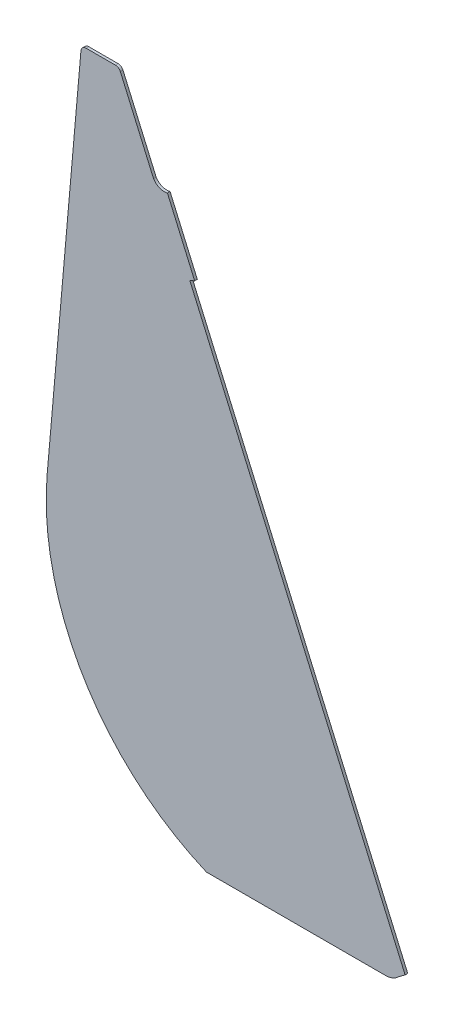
ISO-10303-21;
HEADER;
FILE_DESCRIPTION(('STEP AP214'),'2;1');
FILE_NAME('part.step','',(''),(''),'','','');
FILE_SCHEMA(('AUTOMOTIVE_DESIGN { 1 0 10303 214 1 1 1 1 }'));
ENDSEC;
DATA;
#1=APPLICATION_CONTEXT('core data for automotive mechanical design processes');
#2=APPLICATION_PROTOCOL_DEFINITION('international standard','automotive_design',2000,#1);
#3=PRODUCT_CONTEXT('',#1,'mechanical');
#4=PRODUCT('Part','Part','',(#3));
#5=PRODUCT_RELATED_PRODUCT_CATEGORY('part','',(#4));
#6=PRODUCT_DEFINITION_FORMATION('','',#4);
#7=PRODUCT_DEFINITION_CONTEXT('part definition',#1,'design');
#8=PRODUCT_DEFINITION('design','',#6,#7);
#9=PRODUCT_DEFINITION_SHAPE('','',#8);
#10=(LENGTH_UNIT() NAMED_UNIT(*) SI_UNIT(.MILLI.,.METRE.));
#11=(NAMED_UNIT(*) PLANE_ANGLE_UNIT() SI_UNIT($,.RADIAN.));
#12=(NAMED_UNIT(*) SI_UNIT($,.STERADIAN.) SOLID_ANGLE_UNIT());
#13=UNCERTAINTY_MEASURE_WITH_UNIT(LENGTH_MEASURE(1.E-05),#10,'distance_accuracy_value','');
#14=(GEOMETRIC_REPRESENTATION_CONTEXT(3) GLOBAL_UNCERTAINTY_ASSIGNED_CONTEXT((#13)) GLOBAL_UNIT_ASSIGNED_CONTEXT((#10,
#11,#12)) REPRESENTATION_CONTEXT('',''));
#15=CARTESIAN_POINT('',(0.,0.,0.));
#16=DIRECTION('',(0.,0.,1.));
#17=DIRECTION('',(1.,0.,0.));
#18=AXIS2_PLACEMENT_3D('',#15,#16,#17);
#19=CARTESIAN_POINT('',(-175.372398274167,407.66313630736,3.175));
#20=DIRECTION('',(0.,0.,-1.));
#21=DIRECTION('',(-1.,0.,0.));
#22=AXIS2_PLACEMENT_3D('',#19,#20,#21);
#23=CYLINDRICAL_SURFACE('',#22,15.0225257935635);
#24=CARTESIAN_POINT('',(-175.372398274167,407.66313630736,0.));
#25=DIRECTION('',(0.,0.,-1.));
#26=DIRECTION('',(-1.,0.,0.));
#27=AXIS2_PLACEMENT_3D('',#24,#25,#26);
#28=CIRCLE('',#27,15.0225257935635);
#29=CARTESIAN_POINT('',(-171.416461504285,393.170833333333,0.));
#30=VERTEX_POINT('',#29);
#31=CARTESIAN_POINT('',(-188.133716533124,399.736911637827,0.));
#32=VERTEX_POINT('',#31);
#33=EDGE_CURVE('E168',#30,#32,#28,.T.);
#34=ORIENTED_EDGE('',*,*,#33,.T.);
#35=DIRECTION('',(0.,0.,-1.));
#36=VECTOR('',#35,1.);
#37=CARTESIAN_POINT('',(-188.133716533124,399.736911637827,3.175));
#38=LINE('',#37,#36);
#39=CARTESIAN_POINT('',(-188.133716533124,399.736911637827,3.175));
#40=VERTEX_POINT('',#39);
#41=EDGE_CURVE('E46',#40,#32,#38,.T.);
#42=ORIENTED_EDGE('',*,*,#41,.F.);
#43=CARTESIAN_POINT('',(-175.372398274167,407.66313630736,3.175));
#44=DIRECTION('',(0.,0.,-1.));
#45=DIRECTION('',(-1.,0.,0.));
#46=AXIS2_PLACEMENT_3D('',#43,#44,#45);
#47=CIRCLE('',#46,15.0225257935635);
#48=CARTESIAN_POINT('',(-171.416461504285,393.170833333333,3.175));
#49=VERTEX_POINT('',#48);
#50=EDGE_CURVE('E219',#49,#40,#47,.T.);
#51=ORIENTED_EDGE('',*,*,#50,.F.);
#52=DIRECTION('',(0.,0.,-1.));
#53=VECTOR('',#52,1.);
#54=CARTESIAN_POINT('',(-171.416461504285,393.170833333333,3.175));
#55=LINE('',#54,#53);
#56=EDGE_CURVE('E11',#49,#30,#55,.T.);
#57=ORIENTED_EDGE('',*,*,#56,.T.);
#58=EDGE_LOOP('',(#34,#42,#51,#57));
#59=FACE_BOUND('',#58,.T.);
#60=ADVANCED_FACE('F38',(#59),#23,.F.);
#61=CARTESIAN_POINT('',(-224.260753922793,482.6,3.175));
#62=DIRECTION('',(-0.916666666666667,-0.399652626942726,0.));
#63=DIRECTION('',(0.399652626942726,-0.916666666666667,0.));
#64=AXIS2_PLACEMENT_3D('',#61,#62,#63);
#65=PLANE('',#64);
#66=DIRECTION('',(-0.399652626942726,0.916666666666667,0.));
#67=VECTOR('',#66,1.);
#68=CARTESIAN_POINT('',(-224.260753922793,482.6,0.));
#69=LINE('',#68,#67);
#70=CARTESIAN_POINT('',(-228.135696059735,491.487794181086,0.));
#71=VERTEX_POINT('',#70);
#72=EDGE_CURVE('E171',#32,#71,#69,.T.);
#73=ORIENTED_EDGE('',*,*,#72,.T.);
#74=DIRECTION('',(0.,0.,-1.));
#75=VECTOR('',#74,1.);
#76=CARTESIAN_POINT('',(-228.135696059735,491.487794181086,3.175));
#77=LINE('',#76,#75);
#78=CARTESIAN_POINT('',(-228.135696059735,491.487794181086,3.175));
#79=VERTEX_POINT('',#78);
#80=EDGE_CURVE('E208',#79,#71,#77,.T.);
#81=ORIENTED_EDGE('',*,*,#80,.F.);
#82=DIRECTION('',(-0.399652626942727,0.916666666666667,0.));
#83=VECTOR('',#82,1.);
#84=CARTESIAN_POINT('',(-188.133716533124,399.736911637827,3.175));
#85=LINE('',#84,#83);
#86=EDGE_CURVE('E216',#40,#79,#85,.T.);
#87=ORIENTED_EDGE('',*,*,#86,.F.);
#88=ORIENTED_EDGE('',*,*,#41,.T.);
#89=EDGE_LOOP('',(#73,#81,#87,#88));
#90=FACE_BOUND('',#89,.T.);
#91=ADVANCED_FACE('F214',(#90),#65,.F.);
#92=CARTESIAN_POINT('',(-233.956529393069,488.95,3.175));
#93=DIRECTION('',(0.,0.,-1.));
#94=DIRECTION('',(-1.,0.,0.));
#95=AXIS2_PLACEMENT_3D('',#92,#93,#94);
#96=CYLINDRICAL_SURFACE('',#95,6.34999999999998);
#97=CARTESIAN_POINT('',(-233.956529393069,488.95,0.));
#98=DIRECTION('',(0.,0.,1.));
#99=DIRECTION('',(1.,0.,0.));
#100=AXIS2_PLACEMENT_3D('',#97,#98,#99);
#101=CIRCLE('',#100,6.34999999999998);
#102=CARTESIAN_POINT('',(-233.956529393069,495.3,0.));
#103=VERTEX_POINT('',#102);
#104=EDGE_CURVE('E174',#71,#103,#101,.T.);
#105=ORIENTED_EDGE('',*,*,#104,.T.);
#106=DIRECTION('',(0.,0.,-1.));
#107=VECTOR('',#106,1.);
#108=CARTESIAN_POINT('',(-233.956529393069,495.3,3.175));
#109=LINE('',#108,#107);
#110=CARTESIAN_POINT('',(-233.956529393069,495.3,3.175));
#111=VERTEX_POINT('',#110);
#112=EDGE_CURVE('E205',#111,#103,#109,.T.);
#113=ORIENTED_EDGE('',*,*,#112,.F.);
#114=CARTESIAN_POINT('',(-233.956529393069,488.95,3.175));
#115=DIRECTION('',(0.,0.,1.));
#116=DIRECTION('',(1.,0.,0.));
#117=AXIS2_PLACEMENT_3D('',#114,#115,#116);
#118=CIRCLE('',#117,6.34999999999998);
#119=EDGE_CURVE('E241',#79,#111,#118,.T.);
#120=ORIENTED_EDGE('',*,*,#119,.F.);
#121=ORIENTED_EDGE('',*,*,#80,.T.);
#122=EDGE_LOOP('',(#105,#113,#120,#121));
#123=FACE_BOUND('',#122,.T.);
#124=ADVANCED_FACE('F232',(#123),#96,.T.);
#125=CARTESIAN_POINT('',(-233.956529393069,495.3,3.175));
#126=DIRECTION('',(0.,-1.,0.));
#127=DIRECTION('',(0.,0.,-1.));
#128=AXIS2_PLACEMENT_3D('',#125,#126,#127);
#129=PLANE('',#128);
#130=DIRECTION('',(-1.,0.,0.));
#131=VECTOR('',#130,1.);
#132=CARTESIAN_POINT('',(-233.956529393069,495.3,0.));
#133=LINE('',#132,#131);
#134=CARTESIAN_POINT('',(-269.302608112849,495.3,0.));
#135=VERTEX_POINT('',#134);
#136=EDGE_CURVE('E176',#103,#135,#133,.T.);
#137=ORIENTED_EDGE('',*,*,#136,.T.);
#138=DIRECTION('',(0.,0.,-1.));
#139=VECTOR('',#138,1.);
#140=CARTESIAN_POINT('',(-269.302608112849,495.3,3.175));
#141=LINE('',#140,#139);
#142=CARTESIAN_POINT('',(-269.302608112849,495.3,3.175));
#143=VERTEX_POINT('',#142);
#144=EDGE_CURVE('E202',#143,#135,#141,.T.);
#145=ORIENTED_EDGE('',*,*,#144,.F.);
#146=DIRECTION('',(-1.,0.,0.));
#147=VECTOR('',#146,1.);
#148=CARTESIAN_POINT('',(-233.956529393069,495.3,3.175));
#149=LINE('',#148,#147);
#150=EDGE_CURVE('E238',#111,#143,#149,.T.);
#151=ORIENTED_EDGE('',*,*,#150,.F.);
#152=ORIENTED_EDGE('',*,*,#112,.T.);
#153=EDGE_LOOP('',(#137,#145,#151,#152));
#154=FACE_BOUND('',#153,.T.);
#155=ADVANCED_FACE('F236',(#154),#129,.F.);
#156=CARTESIAN_POINT('',(-269.302608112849,488.95,3.175));
#157=DIRECTION('',(0.,0.,-1.));
#158=DIRECTION('',(-1.,0.,0.));
#159=AXIS2_PLACEMENT_3D('',#156,#157,#158);
#160=CYLINDRICAL_SURFACE('',#159,6.35000000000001);
#161=CARTESIAN_POINT('',(-269.302608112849,488.95,0.));
#162=DIRECTION('',(0.,0.,1.));
#163=DIRECTION('',(1.,0.,0.));
#164=AXIS2_PLACEMENT_3D('',#161,#162,#163);
#165=CIRCLE('',#164,6.35000000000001);
#166=CARTESIAN_POINT('',(-275.628136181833,489.506951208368,0.));
#167=VERTEX_POINT('',#166);
#168=EDGE_CURVE('E178',#135,#167,#165,.T.);
#169=ORIENTED_EDGE('',*,*,#168,.T.);
#170=DIRECTION('',(0.,0.,-1.));
#171=VECTOR('',#170,1.);
#172=CARTESIAN_POINT('',(-275.628136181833,489.506951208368,3.175));
#173=LINE('',#172,#171);
#174=CARTESIAN_POINT('',(-275.628136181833,489.506951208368,3.175));
#175=VERTEX_POINT('',#174);
#176=EDGE_CURVE('E199',#175,#167,#173,.T.);
#177=ORIENTED_EDGE('',*,*,#176,.F.);
#178=CARTESIAN_POINT('',(-269.302608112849,488.95,3.175));
#179=DIRECTION('',(0.,0.,1.));
#180=DIRECTION('',(1.,0.,0.));
#181=AXIS2_PLACEMENT_3D('',#178,#179,#180);
#182=CIRCLE('',#181,6.35000000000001);
#183=EDGE_CURVE('E240',#143,#175,#182,.T.);
#184=ORIENTED_EDGE('',*,*,#183,.F.);
#185=ORIENTED_EDGE('',*,*,#144,.T.);
#186=EDGE_LOOP('',(#169,#177,#184,#185));
#187=FACE_BOUND('',#186,.T.);
#188=ADVANCED_FACE('F303',(#187),#160,.T.);
#189=CARTESIAN_POINT('',(-275.628136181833,489.506951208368,3.175));
#190=DIRECTION('',(0.996146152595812,-0.0877088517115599,0.));
#191=DIRECTION('',(0.0877088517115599,0.996146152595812,0.));
#192=AXIS2_PLACEMENT_3D('',#189,#190,#191);
#193=PLANE('',#192);
#194=DIRECTION('',(-0.0877088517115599,-0.996146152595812,0.));
#195=VECTOR('',#194,1.);
#196=CARTESIAN_POINT('',(-275.628136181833,489.506951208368,0.));
#197=LINE('',#196,#195);
#198=CARTESIAN_POINT('',(-316.27640344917,27.8475604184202,0.));
#199=VERTEX_POINT('',#198);
#200=EDGE_CURVE('E180',#167,#199,#197,.T.);
#201=ORIENTED_EDGE('',*,*,#200,.T.);
#202=DIRECTION('',(0.,0.,-1.));
#203=VECTOR('',#202,1.);
#204=CARTESIAN_POINT('',(-316.27640344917,27.8475604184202,3.175));
#205=LINE('',#204,#203);
#206=CARTESIAN_POINT('',(-316.27640344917,27.8475604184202,3.175));
#207=VERTEX_POINT('',#206);
#208=EDGE_CURVE('E153',#207,#199,#205,.T.);
#209=ORIENTED_EDGE('',*,*,#208,.F.);
#210=DIRECTION('',(-0.0877088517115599,-0.996146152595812,0.));
#211=VECTOR('',#210,1.);
#212=CARTESIAN_POINT('',(-275.628136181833,489.506951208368,3.175));
#213=LINE('',#212,#211);
#214=EDGE_CURVE('E142',#175,#207,#213,.T.);
#215=ORIENTED_EDGE('',*,*,#214,.F.);
#216=ORIENTED_EDGE('',*,*,#176,.T.);
#217=EDGE_LOOP('',(#201,#209,#215,#216));
#218=FACE_BOUND('',#217,.T.);
#219=ADVANCED_FACE('F300',(#218),#193,.F.);
#220=CARTESIAN_POINT('',(0.,0.,3.175));
#221=DIRECTION('',(0.,0.,-1.));
#222=DIRECTION('',(-1.,0.,0.));
#223=AXIS2_PLACEMENT_3D('',#220,#221,#222);
#224=CYLINDRICAL_SURFACE('',#223,317.5);
#225=CARTESIAN_POINT('',(0.,0.,0.));
#226=DIRECTION('',(0.,0.,1.));
#227=DIRECTION('',(1.,0.,0.));
#228=AXIS2_PLACEMENT_3D('',#225,#226,#227);
#229=CIRCLE('',#228,317.5);
#230=CARTESIAN_POINT('',(-124.434078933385,-292.1,0.));
#231=VERTEX_POINT('',#230);
#232=EDGE_CURVE('E151',#199,#231,#229,.T.);
#233=ORIENTED_EDGE('',*,*,#232,.T.);
#234=DIRECTION('',(0.,0.,-1.));
#235=VECTOR('',#234,1.);
#236=CARTESIAN_POINT('',(-124.434078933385,-292.1,3.175));
#237=LINE('',#236,#235);
#238=CARTESIAN_POINT('',(-124.434078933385,-292.1,3.175));
#239=VERTEX_POINT('',#238);
#240=EDGE_CURVE('E148',#239,#231,#237,.T.);
#241=ORIENTED_EDGE('',*,*,#240,.F.);
#242=CARTESIAN_POINT('',(0.,0.,3.175));
#243=DIRECTION('',(0.,0.,1.));
#244=DIRECTION('',(1.,0.,0.));
#245=AXIS2_PLACEMENT_3D('',#242,#243,#244);
#246=CIRCLE('',#245,317.5);
#247=EDGE_CURVE('E136',#207,#239,#246,.T.);
#248=ORIENTED_EDGE('',*,*,#247,.F.);
#249=ORIENTED_EDGE('',*,*,#208,.T.);
#250=EDGE_LOOP('',(#233,#241,#248,#249));
#251=FACE_BOUND('',#250,.T.);
#252=ADVANCED_FACE('F149',(#251),#224,.T.);
#253=CARTESIAN_POINT('',(-124.434078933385,-292.1,3.175));
#254=DIRECTION('',(0.,1.,0.));
#255=DIRECTION('',(-1.,0.,0.));
#256=AXIS2_PLACEMENT_3D('',#253,#254,#255);
#257=PLANE('',#256);
#258=DIRECTION('',(1.,0.,0.));
#259=VECTOR('',#258,1.);
#260=CARTESIAN_POINT('',(-124.434078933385,-292.1,0.));
#261=LINE('',#260,#259);
#262=CARTESIAN_POINT('',(91.44,-292.1,0.));
#263=VERTEX_POINT('',#262);
#264=EDGE_CURVE('E96',#231,#263,#261,.T.);
#265=ORIENTED_EDGE('',*,*,#264,.T.);
#266=DIRECTION('',(0.,0.,-1.));
#267=VECTOR('',#266,1.);
#268=CARTESIAN_POINT('',(91.44,-292.1,3.175));
#269=LINE('',#268,#267);
#270=CARTESIAN_POINT('',(91.44,-292.1,3.175));
#271=VERTEX_POINT('',#270);
#272=EDGE_CURVE('E154',#271,#263,#269,.T.);
#273=ORIENTED_EDGE('',*,*,#272,.F.);
#274=DIRECTION('',(1.,0.,0.));
#275=VECTOR('',#274,1.);
#276=CARTESIAN_POINT('',(-124.434078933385,-292.1,3.175));
#277=LINE('',#276,#275);
#278=EDGE_CURVE('E140',#239,#271,#277,.T.);
#279=ORIENTED_EDGE('',*,*,#278,.F.);
#280=ORIENTED_EDGE('',*,*,#240,.T.);
#281=EDGE_LOOP('',(#265,#273,#279,#280));
#282=FACE_BOUND('',#281,.T.);
#283=ADVANCED_FACE('F156',(#282),#257,.F.);
#284=CARTESIAN_POINT('',(91.44,-269.875,3.175));
#285=DIRECTION('',(0.,0.,-1.));
#286=DIRECTION('',(-1.,0.,0.));
#287=AXIS2_PLACEMENT_3D('',#284,#285,#286);
#288=CYLINDRICAL_SURFACE('',#287,22.225);
#289=CARTESIAN_POINT('',(91.44,-269.875,0.));
#290=DIRECTION('',(0.,0.,1.));
#291=DIRECTION('',(1.,0.,0.));
#292=AXIS2_PLACEMENT_3D('',#289,#290,#291);
#293=CIRCLE('',#292,22.225);
#294=CARTESIAN_POINT('',(107.309314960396,-285.435060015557,0.));
#295=VERTEX_POINT('',#294);
#296=EDGE_CURVE('E103',#263,#295,#293,.T.);
#297=ORIENTED_EDGE('',*,*,#296,.T.);
#298=DIRECTION('',(0.,0.,-1.));
#299=VECTOR('',#298,1.);
#300=CARTESIAN_POINT('',(107.309314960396,-285.435060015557,3.175));
#301=LINE('',#300,#299);
#302=CARTESIAN_POINT('',(107.309314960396,-285.435060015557,3.175));
#303=VERTEX_POINT('',#302);
#304=EDGE_CURVE('E167',#303,#295,#301,.T.);
#305=ORIENTED_EDGE('',*,*,#304,.F.);
#306=CARTESIAN_POINT('',(91.44,-269.875,3.175));
#307=DIRECTION('',(0.,0.,1.));
#308=DIRECTION('',(1.,0.,0.));
#309=AXIS2_PLACEMENT_3D('',#306,#307,#308);
#310=CIRCLE('',#309,22.225);
#311=EDGE_CURVE('E57',#271,#303,#310,.T.);
#312=ORIENTED_EDGE('',*,*,#311,.F.);
#313=ORIENTED_EDGE('',*,*,#272,.T.);
#314=EDGE_LOOP('',(#297,#305,#312,#313));
#315=FACE_BOUND('',#314,.T.);
#316=ADVANCED_FACE('F353',(#315),#288,.T.);
#317=CARTESIAN_POINT('',(120.261045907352,-275.837776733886,3.175));
#318=DIRECTION('',(-0.595364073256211,0.803456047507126,0.));
#319=DIRECTION('',(-0.803456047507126,-0.595364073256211,0.));
#320=AXIS2_PLACEMENT_3D('',#317,#318,#319);
#321=PLANE('',#320);
#322=DIRECTION('',(0.803456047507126,0.595364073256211,0.));
#323=VECTOR('',#322,1.);
#324=CARTESIAN_POINT('',(120.261045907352,-275.837776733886,0.));
#325=LINE('',#324,#323);
#326=CARTESIAN_POINT('',(115.025274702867,-279.717503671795,0.));
#327=VERTEX_POINT('',#326);
#328=EDGE_CURVE('E187',#295,#327,#325,.T.);
#329=ORIENTED_EDGE('',*,*,#328,.T.);
#330=DIRECTION('',(0.,0.,1.));
#331=VECTOR('',#330,1.);
#332=CARTESIAN_POINT('',(115.025274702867,-279.717503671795,3.175));
#333=LINE('',#332,#331);
#334=CARTESIAN_POINT('',(115.025274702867,-279.717503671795,3.175));
#335=VERTEX_POINT('',#334);
#336=EDGE_CURVE('E262',#327,#335,#333,.T.);
#337=ORIENTED_EDGE('',*,*,#336,.T.);
#338=DIRECTION('',(0.803456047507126,0.595364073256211,0.));
#339=VECTOR('',#338,1.);
#340=CARTESIAN_POINT('',(120.261045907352,-275.837776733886,3.175));
#341=LINE('',#340,#339);
#342=EDGE_CURVE('E161',#303,#335,#341,.T.);
#343=ORIENTED_EDGE('',*,*,#342,.F.);
#344=ORIENTED_EDGE('',*,*,#304,.T.);
#345=EDGE_LOOP('',(#329,#337,#343,#344));
#346=FACE_BOUND('',#345,.T.);
#347=ADVANCED_FACE('F279',(#346),#321,.F.);
#348=CARTESIAN_POINT('',(116.277115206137,-266.7,3.175));
#349=DIRECTION('',(-0.916666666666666,-0.399652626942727,0.));
#350=DIRECTION('',(0.399652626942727,-0.916666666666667,0.));
#351=AXIS2_PLACEMENT_3D('',#348,#349,#350);
#352=PLANE('',#351);
#353=DIRECTION('',(-0.399652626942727,0.916666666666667,0.));
#354=VECTOR('',#353,1.);
#355=CARTESIAN_POINT('',(0.,0.,3.175));
#356=LINE('',#355,#354);
#357=CARTESIAN_POINT('',(-138.593960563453,317.887223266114,3.175));
#358=VERTEX_POINT('',#357);
#359=EDGE_CURVE('E111',#358,#49,#356,.T.);
#360=ORIENTED_EDGE('',*,*,#359,.F.);
#361=DIRECTION('',(0.,0.,1.));
#362=VECTOR('',#361,1.);
#363=CARTESIAN_POINT('',(-138.593960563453,317.887223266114,0.));
#364=LINE('',#363,#362);
#365=CARTESIAN_POINT('',(-138.593960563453,317.887223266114,0.));
#366=VERTEX_POINT('',#365);
#367=EDGE_CURVE('E257',#366,#358,#364,.T.);
#368=ORIENTED_EDGE('',*,*,#367,.F.);
#369=DIRECTION('',(-0.399652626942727,0.916666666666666,0.));
#370=VECTOR('',#369,1.);
#371=CARTESIAN_POINT('',(116.277115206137,-266.7,0.));
#372=LINE('',#371,#370);
#373=EDGE_CURVE('E191',#366,#30,#372,.T.);
#374=ORIENTED_EDGE('',*,*,#373,.T.);
#375=ORIENTED_EDGE('',*,*,#56,.F.);
#376=EDGE_LOOP('',(#360,#368,#374,#375));
#377=FACE_BOUND('',#376,.T.);
#378=ADVANCED_FACE('F368',(#377),#352,.F.);
#379=CARTESIAN_POINT('',(-175.372398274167,407.66313630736,3.175));
#380=DIRECTION('',(0.,0.,-1.));
#381=DIRECTION('',(-1.,0.,0.));
#382=AXIS2_PLACEMENT_3D('',#379,#380,#381);
#383=PLANE('',#382);
#384=ORIENTED_EDGE('',*,*,#342,.T.);
#385=DIRECTION('',(0.399652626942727,-0.916666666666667,0.));
#386=VECTOR('',#385,1.);
#387=CARTESIAN_POINT('',(114.440212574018,-278.375570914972,3.175));
#388=LINE('',#387,#386);
#389=CARTESIAN_POINT('',(-144.414793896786,315.349429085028,3.175));
#390=VERTEX_POINT('',#389);
#391=EDGE_CURVE('E254',#390,#335,#388,.T.);
#392=ORIENTED_EDGE('',*,*,#391,.F.);
#393=DIRECTION('',(0.916666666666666,0.399652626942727,0.));
#394=VECTOR('',#393,1.);
#395=CARTESIAN_POINT('',(-144.414793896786,315.349429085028,3.175));
#396=LINE('',#395,#394);
#397=EDGE_CURVE('E172',#390,#358,#396,.T.);
#398=ORIENTED_EDGE('',*,*,#397,.T.);
#399=ORIENTED_EDGE('',*,*,#359,.T.);
#400=ORIENTED_EDGE('',*,*,#50,.T.);
#401=ORIENTED_EDGE('',*,*,#86,.T.);
#402=ORIENTED_EDGE('',*,*,#119,.T.);
#403=ORIENTED_EDGE('',*,*,#150,.T.);
#404=ORIENTED_EDGE('',*,*,#183,.T.);
#405=ORIENTED_EDGE('',*,*,#214,.T.);
#406=ORIENTED_EDGE('',*,*,#247,.T.);
#407=ORIENTED_EDGE('',*,*,#278,.T.);
#408=ORIENTED_EDGE('',*,*,#311,.T.);
#409=EDGE_LOOP('',(#384,#392,#398,#399,#400,#401,#402,#403,#404,#405,#406,#407,#408));
#410=FACE_BOUND('',#409,.T.);
#411=ADVANCED_FACE('F138',(#410),#383,.F.);
#412=CARTESIAN_POINT('',(-175.372398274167,407.66313630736,0.));
#413=DIRECTION('',(0.,0.,-1.));
#414=DIRECTION('',(-1.,0.,0.));
#415=AXIS2_PLACEMENT_3D('',#412,#413,#414);
#416=PLANE('',#415);
#417=DIRECTION('',(-0.399652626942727,0.916666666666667,0.));
#418=VECTOR('',#417,1.);
#419=CARTESIAN_POINT('',(114.440212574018,-278.375570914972,0.));
#420=LINE('',#419,#418);
#421=CARTESIAN_POINT('',(-144.414793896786,315.349429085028,0.));
#422=VERTEX_POINT('',#421);
#423=EDGE_CURVE('E261',#327,#422,#420,.T.);
#424=ORIENTED_EDGE('',*,*,#423,.F.);
#425=ORIENTED_EDGE('',*,*,#328,.F.);
#426=ORIENTED_EDGE('',*,*,#296,.F.);
#427=ORIENTED_EDGE('',*,*,#264,.F.);
#428=ORIENTED_EDGE('',*,*,#232,.F.);
#429=ORIENTED_EDGE('',*,*,#200,.F.);
#430=ORIENTED_EDGE('',*,*,#168,.F.);
#431=ORIENTED_EDGE('',*,*,#136,.F.);
#432=ORIENTED_EDGE('',*,*,#104,.F.);
#433=ORIENTED_EDGE('',*,*,#72,.F.);
#434=ORIENTED_EDGE('',*,*,#33,.F.);
#435=ORIENTED_EDGE('',*,*,#373,.F.);
#436=DIRECTION('',(0.916666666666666,0.399652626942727,0.));
#437=VECTOR('',#436,1.);
#438=CARTESIAN_POINT('',(-144.414793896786,315.349429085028,0.));
#439=LINE('',#438,#437);
#440=EDGE_CURVE('E250',#422,#366,#439,.T.);
#441=ORIENTED_EDGE('',*,*,#440,.F.);
#442=EDGE_LOOP('',(#424,#425,#426,#427,#428,#429,#430,#431,#432,#433,#434,#435,#441));
#443=FACE_BOUND('',#442,.T.);
#444=ADVANCED_FACE('F224',(#443),#416,.T.);
#445=CARTESIAN_POINT('',(-144.414793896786,315.349429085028,0.));
#446=DIRECTION('',(-0.399652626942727,0.916666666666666,0.));
#447=DIRECTION('',(-0.916666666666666,-0.399652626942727,0.));
#448=AXIS2_PLACEMENT_3D('',#445,#446,#447);
#449=PLANE('',#448);
#450=ORIENTED_EDGE('',*,*,#367,.T.);
#451=ORIENTED_EDGE('',*,*,#397,.F.);
#452=DIRECTION('',(0.,0.,1.));
#453=VECTOR('',#452,1.);
#454=CARTESIAN_POINT('',(-144.414793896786,315.349429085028,0.));
#455=LINE('',#454,#453);
#456=EDGE_CURVE('E266',#422,#390,#455,.T.);
#457=ORIENTED_EDGE('',*,*,#456,.F.);
#458=ORIENTED_EDGE('',*,*,#440,.T.);
#459=EDGE_LOOP('',(#450,#451,#457,#458));
#460=FACE_BOUND('',#459,.T.);
#461=ADVANCED_FACE('F291',(#460),#449,.F.);
#462=CARTESIAN_POINT('',(-5.82083333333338,-2.53779418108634,0.));
#463=DIRECTION('',(0.916666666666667,0.399652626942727,0.));
#464=DIRECTION('',(-0.399652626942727,0.916666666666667,0.));
#465=AXIS2_PLACEMENT_3D('',#462,#463,#464);
#466=PLANE('',#465);
#467=ORIENTED_EDGE('',*,*,#423,.T.);
#468=ORIENTED_EDGE('',*,*,#456,.T.);
#469=ORIENTED_EDGE('',*,*,#391,.T.);
#470=ORIENTED_EDGE('',*,*,#336,.F.);
#471=EDGE_LOOP('',(#467,#468,#469,#470));
#472=FACE_BOUND('',#471,.T.);
#473=ADVANCED_FACE('F288',(#472),#466,.T.);
#474=CLOSED_SHELL('',(#60,#91,#124,#155,#188,#219,#252,#283,#316,#347,#378,#411,#444,#461,#473));
#475=MANIFOLD_SOLID_BREP('B2',#474);
#476=ADVANCED_BREP_SHAPE_REPRESENTATION('',(#18,#475),#14);
#477=SHAPE_DEFINITION_REPRESENTATION(#9,#476);
ENDSEC;
END-ISO-10303-21;
